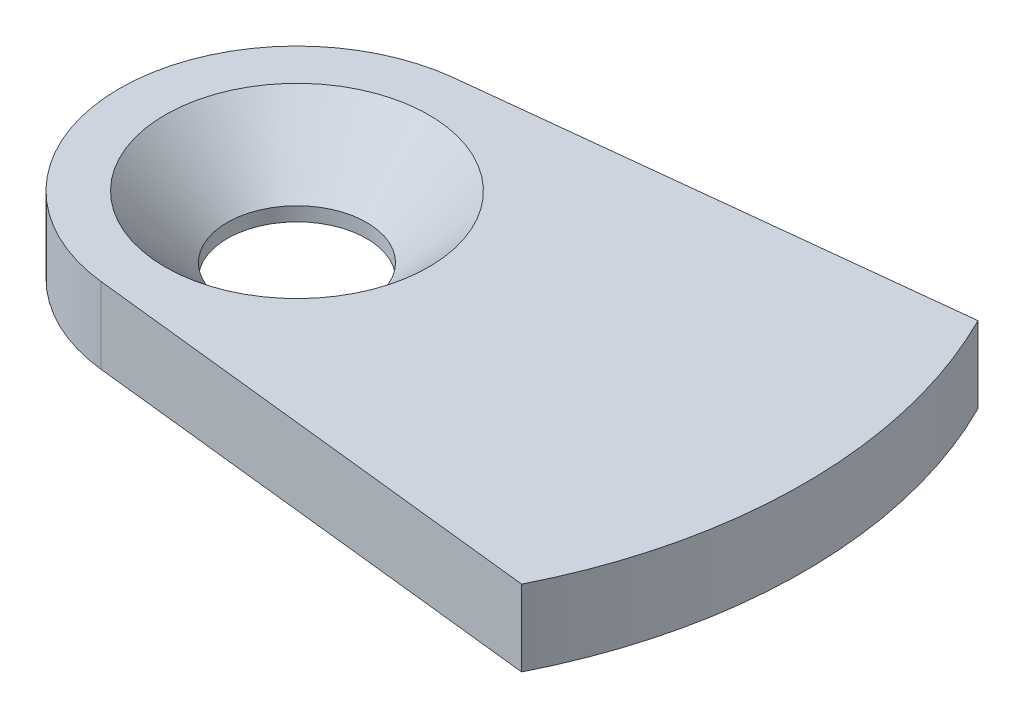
from build123d import *

# Parameters (mm, degrees)
EXTRUDE1_DEPTH = 3


with BuildPart() as part:
    # Sketch1 → Extrude1 (new body)
    with BuildSketch(Plane(origin=(0, 0, 0), x_dir=(1, 0, 0), z_dir=(0, 1, 0))):
        with BuildLine():
            Line((-0.762841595, 6.958309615), (17.860571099, 9))
            ThreePointArc((17.860571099, 9), (20, 0), (17.860571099, -9))
            Line((17.860571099, -9), (-0.762841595, -6.958309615))
            ThreePointArc((-0.762841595, -6.958309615), (-7, 0), (-0.762841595, 6.958309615))
        make_face()
    extrude(amount=EXTRUDE1_DEPTH)

    # Sketch4 → CSK for M5 Countersunk Flat Head Screw1 (revolve, cut)
    with BuildSketch(Plane(origin=(0, 3, 0), x_dir=(0, 0, 1), z_dir=(1, 0, 0))):
        Polygon((0, 0), (0, 3), (2.75, 3), (2.75, 2.45), (5.2, 0), align=None)
    revolve(axis=Axis((0, 9.35, 0), (0, -1, 0)), mode=Mode.SUBTRACT)


solid = part.part
